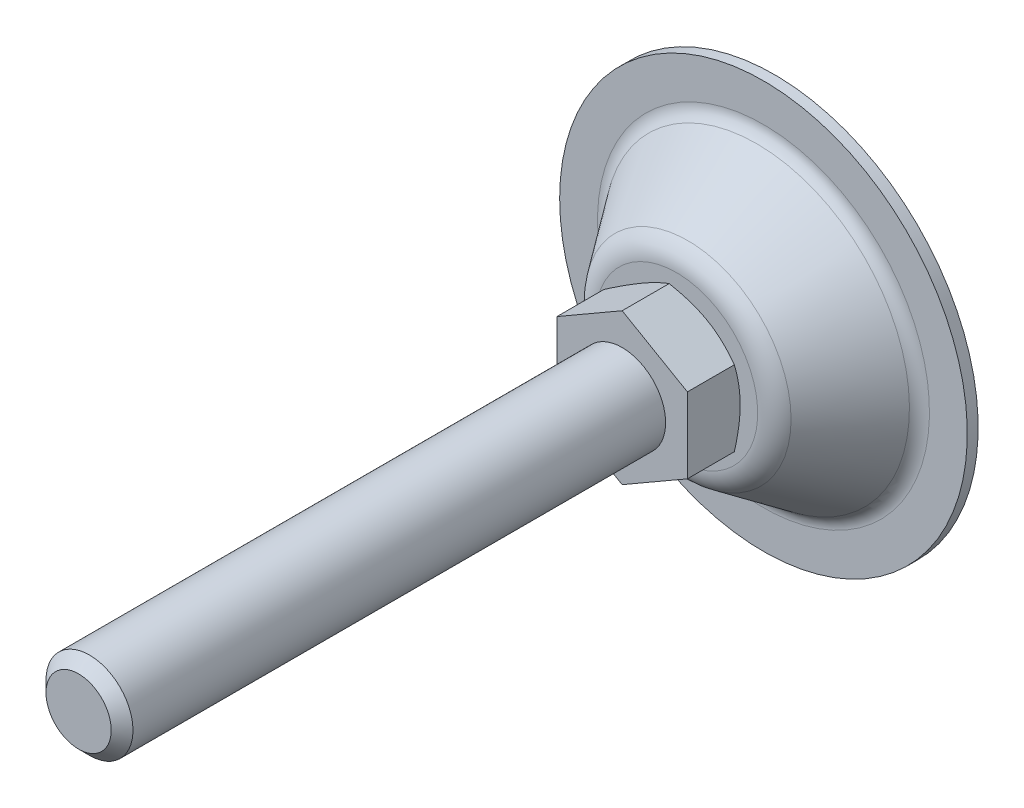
ISO-10303-21;
HEADER;
FILE_DESCRIPTION(('STEP AP214'),'2;1');
FILE_NAME('part.step','',(''),(''),'','','');
FILE_SCHEMA(('AUTOMOTIVE_DESIGN { 1 0 10303 214 1 1 1 1 }'));
ENDSEC;
DATA;
#1=APPLICATION_CONTEXT('core data for automotive mechanical design processes');
#2=APPLICATION_PROTOCOL_DEFINITION('international standard','automotive_design',2000,#1);
#3=PRODUCT_CONTEXT('',#1,'mechanical');
#4=PRODUCT('Part','Part','',(#3));
#5=PRODUCT_RELATED_PRODUCT_CATEGORY('part','',(#4));
#6=PRODUCT_DEFINITION_FORMATION('','',#4);
#7=PRODUCT_DEFINITION_CONTEXT('part definition',#1,'design');
#8=PRODUCT_DEFINITION('design','',#6,#7);
#9=PRODUCT_DEFINITION_SHAPE('','',#8);
#10=(LENGTH_UNIT() NAMED_UNIT(*) SI_UNIT(.MILLI.,.METRE.));
#11=(NAMED_UNIT(*) PLANE_ANGLE_UNIT() SI_UNIT($,.RADIAN.));
#12=(NAMED_UNIT(*) SI_UNIT($,.STERADIAN.) SOLID_ANGLE_UNIT());
#13=UNCERTAINTY_MEASURE_WITH_UNIT(LENGTH_MEASURE(1.E-05),#10,'distance_accuracy_value','');
#14=(GEOMETRIC_REPRESENTATION_CONTEXT(3) GLOBAL_UNCERTAINTY_ASSIGNED_CONTEXT((#13)) GLOBAL_UNIT_ASSIGNED_CONTEXT((#10,
#11,#12)) REPRESENTATION_CONTEXT('',''));
#15=CARTESIAN_POINT('',(0.,0.,0.));
#16=DIRECTION('',(0.,0.,1.));
#17=DIRECTION('',(1.,0.,0.));
#18=AXIS2_PLACEMENT_3D('',#15,#16,#17);
#19=CARTESIAN_POINT('',(0.,0.,28.));
#20=DIRECTION('',(0.,0.,1.));
#21=DIRECTION('',(0.5,-0.866025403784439,0.));
#22=AXIS2_PLACEMENT_3D('',#19,#20,#21);
#23=PLANE('',#22);
#24=DIRECTION('',(0.,1.,0.));
#25=VECTOR('',#24,1.);
#26=CARTESIAN_POINT('',(12.,-6.92820323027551,28.));
#27=LINE('',#26,#25);
#28=CARTESIAN_POINT('',(12.,-6.92820323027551,28.));
#29=VERTEX_POINT('',#28);
#30=CARTESIAN_POINT('',(12.,6.9282032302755,28.));
#31=VERTEX_POINT('',#30);
#32=EDGE_CURVE('E220',#29,#31,#27,.T.);
#33=ORIENTED_EDGE('',*,*,#32,.T.);
#34=DIRECTION('',(-0.866025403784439,0.5,0.));
#35=VECTOR('',#34,1.);
#36=CARTESIAN_POINT('',(12.,6.9282032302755,28.));
#37=LINE('',#36,#35);
#38=CARTESIAN_POINT('',(0.,13.856406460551,28.));
#39=VERTEX_POINT('',#38);
#40=EDGE_CURVE('E361',#31,#39,#37,.T.);
#41=ORIENTED_EDGE('',*,*,#40,.T.);
#42=DIRECTION('',(-0.866025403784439,-0.5,0.));
#43=VECTOR('',#42,1.);
#44=CARTESIAN_POINT('',(0.,13.856406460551,28.));
#45=LINE('',#44,#43);
#46=CARTESIAN_POINT('',(-12.,6.92820323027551,28.));
#47=VERTEX_POINT('',#46);
#48=EDGE_CURVE('E360',#39,#47,#45,.T.);
#49=ORIENTED_EDGE('',*,*,#48,.T.);
#50=DIRECTION('',(0.,-1.,0.));
#51=VECTOR('',#50,1.);
#52=CARTESIAN_POINT('',(-12.,6.92820323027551,28.));
#53=LINE('',#52,#51);
#54=CARTESIAN_POINT('',(-12.,-6.9282032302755,28.));
#55=VERTEX_POINT('',#54);
#56=EDGE_CURVE('E365',#47,#55,#53,.T.);
#57=ORIENTED_EDGE('',*,*,#56,.T.);
#58=DIRECTION('',(0.866025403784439,-0.5,0.));
#59=VECTOR('',#58,1.);
#60=CARTESIAN_POINT('',(-12.,-6.9282032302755,28.));
#61=LINE('',#60,#59);
#62=CARTESIAN_POINT('',(0.,-13.856406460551,28.));
#63=VERTEX_POINT('',#62);
#64=EDGE_CURVE('E367',#55,#63,#61,.T.);
#65=ORIENTED_EDGE('',*,*,#64,.T.);
#66=DIRECTION('',(0.866025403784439,0.5,0.));
#67=VECTOR('',#66,1.);
#68=CARTESIAN_POINT('',(0.,-13.856406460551,28.));
#69=LINE('',#68,#67);
#70=EDGE_CURVE('E37',#63,#29,#69,.T.);
#71=ORIENTED_EDGE('',*,*,#70,.T.);
#72=EDGE_LOOP('',(#33,#41,#49,#57,#65,#71));
#73=FACE_BOUND('',#72,.T.);
#74=CARTESIAN_POINT('',(0.,0.,28.));
#75=DIRECTION('',(0.,0.,1.));
#76=DIRECTION('',(0.5,-0.866025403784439,0.));
#77=AXIS2_PLACEMENT_3D('',#74,#75,#76);
#78=CIRCLE('',#77,8.);
#79=CARTESIAN_POINT('',(4.,-6.92820323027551,28.));
#80=VERTEX_POINT('',#79);
#81=EDGE_CURVE('E224',#80,#80,#78,.T.);
#82=ORIENTED_EDGE('',*,*,#81,.F.);
#83=EDGE_LOOP('',(#82));
#84=FACE_BOUND('',#83,.T.);
#85=ADVANCED_FACE('F14',(#73,#84),#23,.T.);
#86=CARTESIAN_POINT('',(-7.46811554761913,12.9351555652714,18.));
#87=DIRECTION('',(0.,0.,-1.));
#88=DIRECTION('',(-0.5,0.866025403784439,0.));
#89=AXIS2_PLACEMENT_3D('',#86,#87,#88);
#90=PLANE('',#89);
#91=CARTESIAN_POINT('',(-1.37317446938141E-13,2.37840794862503E-13,18.));
#92=DIRECTION('',(0.,0.,1.));
#93=DIRECTION('',(0.5,-0.866025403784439,0.));
#94=AXIS2_PLACEMENT_3D('',#91,#92,#93);
#95=CIRCLE('',#94,14.936231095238);
#96=CARTESIAN_POINT('',(7.46811554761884,-12.9351555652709,18.));
#97=VERTEX_POINT('',#96);
#98=EDGE_CURVE('E111',#97,#97,#95,.T.);
#99=ORIENTED_EDGE('',*,*,#98,.T.);
#100=EDGE_LOOP('',(#99));
#101=FACE_BOUND('',#100,.T.);
#102=CARTESIAN_POINT('',(0.,0.,18.));
#103=DIRECTION('',(0.,0.,-1.));
#104=DIRECTION('',(-0.5,0.866025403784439,0.));
#105=AXIS2_PLACEMENT_3D('',#102,#103,#104);
#106=CIRCLE('',#105,11.5);
#107=CARTESIAN_POINT('',(-5.75,9.95929214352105,18.));
#108=VERTEX_POINT('',#107);
#109=EDGE_CURVE('E84',#108,#108,#106,.T.);
#110=ORIENTED_EDGE('',*,*,#109,.T.);
#111=EDGE_LOOP('',(#110));
#112=FACE_BOUND('',#111,.T.);
#113=ADVANCED_FACE('F195',(#101,#112),#90,.F.);
#114=CARTESIAN_POINT('',(-1.54390389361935E-13,2.67411998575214E-13,4.9999999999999));
#115=DIRECTION('',(0.,0.,1.));
#116=DIRECTION('',(0.5,-0.866025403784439,0.));
#117=AXIS2_PLACEMENT_3D('',#114,#115,#116);
#118=TOROIDAL_SURFACE('',#117,30.5382613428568,3.);
#119=CARTESIAN_POINT('',(-1.55741344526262E-13,2.69751921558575E-13,3.24909185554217));
#120=DIRECTION('',(0.,0.,1.));
#121=DIRECTION('',(0.5,-0.866025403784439,0.));
#122=AXIS2_PLACEMENT_3D('',#119,#120,#121);
#123=CIRCLE('',#122,28.1022152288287);
#124=CARTESIAN_POINT('',(14.0511076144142,-24.3372322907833,3.2490918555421));
#125=VERTEX_POINT('',#124);
#126=EDGE_CURVE('E73',#125,#125,#123,.T.);
#127=ORIENTED_EDGE('',*,*,#126,.F.);
#128=EDGE_LOOP('',(#127));
#129=FACE_BOUND('',#128,.T.);
#130=CARTESIAN_POINT('',(-1.57301461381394E-13,2.72454123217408E-13,1.99999999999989));
#131=DIRECTION('',(0.,0.,1.));
#132=DIRECTION('',(0.5,-0.866025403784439,0.));
#133=AXIS2_PLACEMENT_3D('',#130,#131,#132);
#134=CIRCLE('',#133,30.5382613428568);
#135=CARTESIAN_POINT('',(15.2691306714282,-26.446910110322,1.99999999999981));
#136=VERTEX_POINT('',#135);
#137=EDGE_CURVE('E102',#136,#136,#134,.T.);
#138=ORIENTED_EDGE('',*,*,#137,.T.);
#139=EDGE_LOOP('',(#138));
#140=FACE_BOUND('',#139,.T.);
#141=ADVANCED_FACE('F198',(#129,#140),#118,.F.);
#142=CARTESIAN_POINT('',(-1.55741344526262E-13,2.69751921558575E-13,3.24909185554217));
#143=DIRECTION('',(0.,0.,-1.));
#144=DIRECTION('',(-0.5,0.866025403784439,0.));
#145=AXIS2_PLACEMENT_3D('',#142,#143,#144);
#146=CONICAL_SURFACE('',#145,28.1022152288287,0.623199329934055);
#147=CARTESIAN_POINT('',(-1.39917641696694E-13,2.42344464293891E-13,15.9181802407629));
#148=DIRECTION('',(0.,0.,1.));
#149=DIRECTION('',(0.5,-0.866025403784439,0.));
#150=AXIS2_PLACEMENT_3D('',#147,#148,#149);
#151=CIRCLE('',#150,18.9963079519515);
#152=CARTESIAN_POINT('',(9.49815397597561,-16.4512852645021,15.9181802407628));
#153=VERTEX_POINT('',#152);
#154=EDGE_CURVE('E114',#153,#153,#151,.T.);
#155=ORIENTED_EDGE('',*,*,#154,.F.);
#156=EDGE_LOOP('',(#155));
#157=FACE_BOUND('',#156,.T.);
#158=ORIENTED_EDGE('',*,*,#126,.T.);
#159=EDGE_LOOP('',(#158));
#160=FACE_BOUND('',#159,.T.);
#161=ADVANCED_FACE('F202',(#157,#160),#146,.T.);
#162=CARTESIAN_POINT('',(-1.43982048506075E-13,2.49384223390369E-13,13.));
#163=DIRECTION('',(0.,0.,1.));
#164=DIRECTION('',(0.5,-0.866025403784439,0.));
#165=AXIS2_PLACEMENT_3D('',#162,#163,#164);
#166=TOROIDAL_SURFACE('',#165,14.9362310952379,5.);
#167=ORIENTED_EDGE('',*,*,#98,.F.);
#168=EDGE_LOOP('',(#167));
#169=FACE_BOUND('',#168,.T.);
#170=ORIENTED_EDGE('',*,*,#154,.T.);
#171=EDGE_LOOP('',(#170));
#172=FACE_BOUND('',#171,.T.);
#173=ADVANCED_FACE('F193',(#169,#172),#166,.T.);
#174=CARTESIAN_POINT('',(-18.75,32.4759526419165,0.));
#175=DIRECTION('',(0.,0.,1.));
#176=DIRECTION('',(0.5,-0.866025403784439,0.));
#177=AXIS2_PLACEMENT_3D('',#174,#175,#176);
#178=PLANE('',#177);
#179=CARTESIAN_POINT('',(-1.59799463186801E-13,2.76780789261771E-13,-1.38777878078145E-13));
#180=DIRECTION('',(0.,0.,1.));
#181=DIRECTION('',(0.5,-0.866025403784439,0.));
#182=AXIS2_PLACEMENT_3D('',#179,#180,#181);
#183=CIRCLE('',#182,37.5);
#184=CARTESIAN_POINT('',(18.7499999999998,-32.4759526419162,-2.32452945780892E-13));
#185=VERTEX_POINT('',#184);
#186=EDGE_CURVE('E108',#185,#185,#183,.T.);
#187=ORIENTED_EDGE('',*,*,#186,.F.);
#188=EDGE_LOOP('',(#187));
#189=FACE_BOUND('',#188,.T.);
#190=ADVANCED_FACE('F189',(#189),#178,.F.);
#191=CARTESIAN_POINT('',(0.,0.,129.670029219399));
#192=DIRECTION('',(0.,0.,1.));
#193=DIRECTION('',(0.5,-0.866025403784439,0.));
#194=AXIS2_PLACEMENT_3D('',#191,#192,#193);
#195=CYLINDRICAL_SURFACE('',#194,37.5);
#196=CARTESIAN_POINT('',(-1.57301461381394E-13,2.72454123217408E-13,1.99999999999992));
#197=DIRECTION('',(0.,0.,1.));
#198=DIRECTION('',(0.5,-0.866025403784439,0.));
#199=AXIS2_PLACEMENT_3D('',#196,#197,#198);
#200=CIRCLE('',#199,37.5);
#201=CARTESIAN_POINT('',(18.7499999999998,-32.4759526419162,1.99999999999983));
#202=VERTEX_POINT('',#201);
#203=EDGE_CURVE('E105',#202,#202,#200,.T.);
#204=ORIENTED_EDGE('',*,*,#203,.F.);
#205=EDGE_LOOP('',(#204));
#206=FACE_BOUND('',#205,.T.);
#207=ORIENTED_EDGE('',*,*,#186,.T.);
#208=EDGE_LOOP('',(#207));
#209=FACE_BOUND('',#208,.T.);
#210=ADVANCED_FACE('F185',(#206,#209),#195,.T.);
#211=CARTESIAN_POINT('',(-18.75,32.4759526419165,2.));
#212=DIRECTION('',(0.,0.,-1.));
#213=DIRECTION('',(-0.5,0.866025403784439,0.));
#214=AXIS2_PLACEMENT_3D('',#211,#212,#213);
#215=PLANE('',#214);
#216=ORIENTED_EDGE('',*,*,#137,.F.);
#217=EDGE_LOOP('',(#216));
#218=FACE_BOUND('',#217,.T.);
#219=ORIENTED_EDGE('',*,*,#203,.T.);
#220=EDGE_LOOP('',(#219));
#221=FACE_BOUND('',#220,.T.);
#222=ADVANCED_FACE('F130',(#218,#221),#215,.F.);
#223=CARTESIAN_POINT('',(0.,0.,23.6283876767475));
#224=DIRECTION('',(0.,0.,1.));
#225=DIRECTION('',(0.5,-0.866025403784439,0.));
#226=AXIS2_PLACEMENT_3D('',#223,#224,#225);
#227=CONICAL_SURFACE('',#226,21.2486534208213,1.0471975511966);
#228=ORIENTED_EDGE('',*,*,#109,.F.);
#229=EDGE_LOOP('',(#228));
#230=FACE_BOUND('',#229,.T.);
#231=CARTESIAN_POINT('',(-10.0532557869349,-19.6606563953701,24.1094504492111));
#232=CARTESIAN_POINT('',(-9.82653838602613,-19.5297610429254,23.9825738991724));
#233=CARTESIAN_POINT('',(-9.59955317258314,-19.398711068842,23.856335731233));
#234=CARTESIAN_POINT('',(-9.14499119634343,-19.1362695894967,23.6052809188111));
#235=CARTESIAN_POINT('',(-8.91741442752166,-19.0048780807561,23.4804642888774));
#236=CARTESIAN_POINT('',(-8.23365135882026,-18.6101072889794,23.1083304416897));
#237=CARTESIAN_POINT('',(-7.77650041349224,-18.346171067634,22.8633674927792));
#238=CARTESIAN_POINT('',(-6.85659953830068,-17.8150660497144,22.3798814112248));
#239=CARTESIAN_POINT('',(-6.39383263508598,-17.5478874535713,22.1414012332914));
#240=CARTESIAN_POINT('',(-5.46459534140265,-17.0113920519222,21.6742979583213));
#241=CARTESIAN_POINT('',(-4.9981251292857,-16.7420753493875,21.4456743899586));
#242=CARTESIAN_POINT('',(-4.04609504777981,-16.1924205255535,20.9939474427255));
#243=CARTESIAN_POINT('',(-3.56039382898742,-15.912000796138,20.7712391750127));
#244=CARTESIAN_POINT('',(-2.58328268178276,-15.3478654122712,20.3428555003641));
#245=CARTESIAN_POINT('',(-2.09187211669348,-15.0641493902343,20.137182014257));
#246=CARTESIAN_POINT('',(-1.10351639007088,-14.4935219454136,19.7483225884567));
#247=CARTESIAN_POINT('',(-0.606584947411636,-14.2066184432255,19.565090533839));
#248=CARTESIAN_POINT('',(0.394451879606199,-13.628669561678,19.2270309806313));
#249=CARTESIAN_POINT('',(0.898554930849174,-13.3376255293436,19.072194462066));
#250=CARTESIAN_POINT('',(1.65882416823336,-12.8986838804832,18.8672836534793));
#251=CARTESIAN_POINT('',(1.91226998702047,-12.7523568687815,18.8036673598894));
#252=CARTESIAN_POINT('',(2.42088138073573,-12.4587099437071,18.6863216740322));
#253=CARTESIAN_POINT('',(2.6760469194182,-12.3113900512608,18.6325920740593));
#254=CARTESIAN_POINT('',(3.18791661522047,-12.0158619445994,18.5359727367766));
#255=CARTESIAN_POINT('',(3.44462075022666,-11.8676537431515,18.4930828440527));
#256=CARTESIAN_POINT('',(3.95929088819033,-11.5705088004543,18.4190010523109));
#257=CARTESIAN_POINT('',(4.2172568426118,-11.4215720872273,18.3878087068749));
#258=CARTESIAN_POINT('',(4.73074751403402,-11.1251081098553,18.3381289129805));
#259=CARTESIAN_POINT('',(4.98626060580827,-10.977587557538,18.319482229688));
#260=CARTESIAN_POINT('',(5.49773994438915,-10.6822848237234,18.294677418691));
#261=CARTESIAN_POINT('',(5.75370618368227,-10.534502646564,18.2885190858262));
#262=CARTESIAN_POINT('',(6.26563805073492,-10.2389386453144,18.2888371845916));
#263=CARTESIAN_POINT('',(6.5216036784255,-10.091156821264,18.295313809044));
#264=CARTESIAN_POINT('',(7.03307268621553,-9.79586005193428,18.3207453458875));
#265=CARTESIAN_POINT('',(7.28857604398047,-9.64834511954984,18.3397008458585));
#266=CARTESIAN_POINT('',(7.90442793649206,-9.29278286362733,18.4000305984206));
#267=CARTESIAN_POINT('',(8.26434066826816,-9.08498715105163,18.4474404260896));
#268=CARTESIAN_POINT('',(8.98145632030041,-8.67096023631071,18.5644233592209));
#269=CARTESIAN_POINT('',(9.33865885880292,-8.46472925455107,18.6339995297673));
#270=CARTESIAN_POINT('',(10.0500214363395,-8.0540238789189,18.7928402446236));
#271=CARTESIAN_POINT('',(10.4041788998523,-7.84955097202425,18.8821200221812));
#272=CARTESIAN_POINT('',(11.1089234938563,-7.44266649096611,19.077650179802));
#273=CARTESIAN_POINT('',(11.4595106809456,-7.24025488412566,19.1839002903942));
#274=CARTESIAN_POINT('',(12.1650627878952,-6.83290418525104,19.4133803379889));
#275=CARTESIAN_POINT('',(12.5199465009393,-6.62801197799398,19.5369408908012));
#276=CARTESIAN_POINT('',(13.2262157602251,-6.22024723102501,19.7966751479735));
#277=CARTESIAN_POINT('',(13.5776012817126,-6.01737470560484,19.9328489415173));
#278=CARTESIAN_POINT('',(14.2770536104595,-5.61354571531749,20.2156602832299));
#279=CARTESIAN_POINT('',(14.6251214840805,-5.41258863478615,20.3622943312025));
#280=CARTESIAN_POINT('',(15.318378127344,-5.01233672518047,20.664315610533));
#281=CARTESIAN_POINT('',(15.6635669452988,-4.81304186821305,20.8197026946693));
#282=CARTESIAN_POINT('',(16.5374507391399,-4.30850482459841,21.2238005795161));
#283=CARTESIAN_POINT('',(17.0644049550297,-4.00426766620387,21.477525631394));
#284=CARTESIAN_POINT('',(18.1134107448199,-3.39862389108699,21.9981888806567));
#285=CARTESIAN_POINT('',(18.635461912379,-3.097217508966,22.2651281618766));
#286=CARTESIAN_POINT('',(19.6756923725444,-2.49664017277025,22.8093074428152));
#287=CARTESIAN_POINT('',(20.1938705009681,-2.19746989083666,23.0865504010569));
#288=CARTESIAN_POINT('',(21.226926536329,-1.60103471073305,23.6490491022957));
#289=CARTESIAN_POINT('',(21.7418045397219,-1.30376975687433,23.9343046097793));
#290=CARTESIAN_POINT('',(22.7695382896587,-0.710407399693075,24.5115723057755));
#291=CARTESIAN_POINT('',(23.2823905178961,-0.414312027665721,24.8035928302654));
#292=CARTESIAN_POINT('',(24.3058697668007,0.176593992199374,25.3927886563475));
#293=CARTESIAN_POINT('',(24.8164967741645,0.471404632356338,25.689963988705));
#294=CARTESIAN_POINT('',(25.835813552,1.05990744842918,26.2884658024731));
#295=CARTESIAN_POINT('',(26.3445036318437,1.35359980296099,26.5897915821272));
#296=CARTESIAN_POINT('',(27.3603325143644,1.94008888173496,27.1959115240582));
#297=CARTESIAN_POINT('',(27.8674713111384,2.23288560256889,27.5007056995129));
#298=CARTESIAN_POINT('',(29.2909254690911,3.05471724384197,28.3613531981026));
#299=CARTESIAN_POINT('',(30.2057559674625,3.58289487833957,28.9204806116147));
#300=CARTESIAN_POINT('',(32.0322611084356,4.63742811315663,30.0456673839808));
#301=CARTESIAN_POINT('',(32.9439356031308,5.16378362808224,30.6117270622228));
#302=CARTESIAN_POINT('',(34.7622656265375,6.2135969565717,31.7474746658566));
#303=CARTESIAN_POINT('',(35.6689280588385,6.73705875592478,32.3171478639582));
#304=CARTESIAN_POINT('',(37.0274616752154,7.52140850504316,33.174659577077));
#305=CARTESIAN_POINT('',(37.4800486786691,7.78270973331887,33.4609880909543));
#306=CARTESIAN_POINT('',(38.3847950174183,8.30506527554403,34.0345430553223));
#307=CARTESIAN_POINT('',(38.8369543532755,8.5661195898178,34.3217695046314));
#308=CARTESIAN_POINT('',(39.2889251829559,8.82706506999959,34.6093910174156));
#309=B_SPLINE_CURVE_WITH_KNOTS('',3,(#231,#232,#233,#234,#235,#236,#237,#238,#239,#240,#241,
#242,#243,#244,#245,#246,#247,#248,#249,#250,#251,#252,#253,#254,#255,#256,#257,#258,#259,#260,
#261,#262,#263,#264,#265,#266,#267,#268,#269,#270,#271,#272,#273,#274,#275,#276,#277,#278,#279,
#280,#281,#282,#283,#284,#285,#286,#287,#288,#289,#290,#291,#292,#293,#294,#295,#296,#297,#298,
#299,#300,#301,#302,#303,#304,#305,#306,#307,#308),.UNSPECIFIED.,.F.,.F.,(4,2,2,2,2,2,2,2,2,2,2,
2,2,2,2,2,2,2,2,2,2,2,2,2,2,2,2,2,2,2,2,2,2,2,2,2,2,2,4),(0.,0.872745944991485,1.74550081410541,
3.49127289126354,5.24667070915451,7.00198449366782,8.81209333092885,10.6224059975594,
12.4289339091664,14.2348869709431,15.1332127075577,16.0315195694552,16.929813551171,
17.8280732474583,18.7147052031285,19.6013225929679,20.4879535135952,21.3746261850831,
22.6287917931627,23.88313089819,25.1384431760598,26.3937355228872,27.6775150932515,
28.9613037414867,30.2446648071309,31.5280042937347,33.5055452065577,35.4832485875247,
37.4615242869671,39.439741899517,41.4205425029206,43.4013549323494,45.3818364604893,
47.3623255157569,50.9478944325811,54.5336291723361,58.1092552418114,59.8969559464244,
61.6846542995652),.UNSPECIFIED.);
#310=CARTESIAN_POINT('',(0.,-13.856406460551,19.3604719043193));
#311=VERTEX_POINT('',#310);
#312=CARTESIAN_POINT('',(12.,-6.92820323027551,19.3604719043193));
#313=VERTEX_POINT('',#312);
#314=EDGE_CURVE('E65',#311,#313,#309,.T.);
#315=ORIENTED_EDGE('',*,*,#314,.F.);
#316=CARTESIAN_POINT('',(-12.0002,-6.92808776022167,19.3605385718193));
#317=CARTESIAN_POINT('',(-11.7364142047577,-7.08038456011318,19.2726247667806));
#318=CARTESIAN_POINT('',(-11.4716448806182,-7.2332492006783,19.1887011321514));
#319=CARTESIAN_POINT('',(-10.9399829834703,-7.54020434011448,19.0299413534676));
#320=CARTESIAN_POINT('',(-10.6730897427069,-7.69429522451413,18.9551081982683));
#321=CARTESIAN_POINT('',(-9.86810959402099,-8.15905073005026,18.7456926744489));
#322=CARTESIAN_POINT('',(-9.32684492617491,-8.47155003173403,18.6265783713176));
#323=CARTESIAN_POINT('',(-8.51686717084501,-8.93919090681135,18.4869061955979));
#324=CARTESIAN_POINT('',(-8.25057389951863,-9.09293539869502,18.4471189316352));
#325=CARTESIAN_POINT('',(-7.71675440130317,-9.40113622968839,18.3803985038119));
#326=CARTESIAN_POINT('',(-7.44922815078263,-9.55559258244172,18.3534655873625));
#327=CARTESIAN_POINT('',(-6.91372963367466,-9.86476279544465,18.3131437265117));
#328=CARTESIAN_POINT('',(-6.64575827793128,-10.0194761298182,18.2997386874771));
#329=CARTESIAN_POINT('',(-6.10956726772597,-10.3290461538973,18.2867582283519));
#330=CARTESIAN_POINT('',(-5.84134762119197,-10.4839028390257,18.2871823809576));
#331=CARTESIAN_POINT('',(-5.3399106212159,-10.7734076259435,18.3008951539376));
#332=CARTESIAN_POINT('',(-5.10665750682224,-10.908076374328,18.3125111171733));
#333=CARTESIAN_POINT('',(-4.64068775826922,-11.1771041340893,18.3459831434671));
#334=CARTESIAN_POINT('',(-4.40797116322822,-11.3114631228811,18.367839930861));
#335=CARTESIAN_POINT('',(-3.94320092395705,-11.5797983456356,18.4214125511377));
#336=CARTESIAN_POINT('',(-3.71114798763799,-11.7137741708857,18.4531365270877));
#337=CARTESIAN_POINT('',(-3.24813003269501,-11.9810977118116,18.5258869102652));
#338=CARTESIAN_POINT('',(-3.01716508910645,-12.1144453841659,18.566913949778));
#339=CARTESIAN_POINT('',(-2.31605804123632,-12.5192297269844,18.7049867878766));
#340=CARTESIAN_POINT('',(-1.84794625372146,-12.789494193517,18.8158000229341));
#341=CARTESIAN_POINT('',(-0.918702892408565,-13.3259930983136,19.0673009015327));
#342=CARTESIAN_POINT('',(-0.457559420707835,-13.5922344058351,19.2079294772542));
#343=CARTESIAN_POINT('',(0.000199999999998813,-13.8565219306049,19.3605385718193));
#344=B_SPLINE_CURVE_WITH_KNOTS('',3,(#316,#317,#318,#319,#320,#321,#322,#323,#324,#325,#326,
#327,#328,#329,#330,#331,#332,#333,#334,#335,#336,#337,#338,#339,#340,#341,#342,#343),
.UNSPECIFIED.,.F.,.F.,(4,2,2,2,2,2,2,2,2,2,2,2,2,4),(0.,0.951004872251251,1.90232158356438,
3.80900466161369,4.73894551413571,5.6689042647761,6.59775529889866,7.52657763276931,
8.3351464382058,9.14377244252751,9.95306755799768,10.7624176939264,12.4167102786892,
14.0677556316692),.UNSPECIFIED.);
#345=CARTESIAN_POINT('',(-12.,-6.9282032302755,19.3604719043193));
#346=VERTEX_POINT('',#345);
#347=EDGE_CURVE('E68',#346,#311,#344,.T.);
#348=ORIENTED_EDGE('',*,*,#347,.F.);
#349=CARTESIAN_POINT('',(-12.,6.92843417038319,19.3605385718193));
#350=CARTESIAN_POINT('',(-12.,6.62384057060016,19.2726247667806));
#351=CARTESIAN_POINT('',(-12.,6.31811128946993,19.1887011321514));
#352=CARTESIAN_POINT('',(-12.,5.70420101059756,19.0299413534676));
#353=CARTESIAN_POINT('',(-12.,5.39601924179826,18.9551081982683));
#354=CARTESIAN_POINT('',(-12.,4.466508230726,18.7456926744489));
#355=CARTESIAN_POINT('',(-12.,3.84150962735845,18.6265783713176));
#356=CARTESIAN_POINT('',(-12.,2.9062278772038,18.4869061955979));
#357=CARTESIAN_POINT('',(-12.,2.59873889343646,18.4471189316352));
#358=CARTESIAN_POINT('',(-12.,1.98233723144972,18.3803985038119));
#359=CARTESIAN_POINT('',(-12.,1.67342452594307,18.3534655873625));
#360=CARTESIAN_POINT('',(-12.,1.05508409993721,18.3131437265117));
#361=CARTESIAN_POINT('',(-12.,0.745657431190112,18.2997386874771));
#362=CARTESIAN_POINT('',(-12.,0.126517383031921,18.2867582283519));
#363=CARTESIAN_POINT('',(-12.,-0.183195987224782,18.2871823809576));
#364=CARTESIAN_POINT('',(-12.,-0.762205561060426,18.3008951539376));
#365=CARTESIAN_POINT('',(-12.,-1.03154305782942,18.3125111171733));
#366=CARTESIAN_POINT('',(-12.,-1.56959857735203,18.3459831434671));
#367=CARTESIAN_POINT('',(-12.,-1.83831655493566,18.367839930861));
#368=CARTESIAN_POINT('',(-12.,-2.37498700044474,18.4214125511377));
#369=CARTESIAN_POINT('',(-12.,-2.64293865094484,18.4531365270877));
#370=CARTESIAN_POINT('',(-12.,-3.17758573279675,18.5258869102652));
#371=CARTESIAN_POINT('',(-12.,-3.4442810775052,18.566913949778));
#372=CARTESIAN_POINT('',(-12.,-4.25384976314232,18.7049867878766));
#373=CARTESIAN_POINT('',(-12.,-4.79437869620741,18.8158000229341));
#374=CARTESIAN_POINT('',(-12.,-5.86737650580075,19.0673009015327));
#375=CARTESIAN_POINT('',(-12.,-6.39985912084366,19.2079294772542));
#376=CARTESIAN_POINT('',(-12.,-6.92843417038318,19.3605385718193));
#377=B_SPLINE_CURVE_WITH_KNOTS('',3,(#349,#350,#351,#352,#353,#354,#355,#356,#357,#358,#359,
#360,#361,#362,#363,#364,#365,#366,#367,#368,#369,#370,#371,#372,#373,#374,#375,#376),
.UNSPECIFIED.,.F.,.F.,(4,2,2,2,2,2,2,2,2,2,2,2,2,4),(0.,0.951004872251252,1.90232158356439,
3.80900466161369,4.73894551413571,5.6689042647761,6.59775529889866,7.52657763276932,
8.3351464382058,9.14377244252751,9.95306755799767,10.7624176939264,12.4167102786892,
14.0677556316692),.UNSPECIFIED.);
#378=CARTESIAN_POINT('',(-12.,6.92820323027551,19.3604719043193));
#379=VERTEX_POINT('',#378);
#380=EDGE_CURVE('E83',#379,#346,#377,.T.);
#381=ORIENTED_EDGE('',*,*,#380,.F.);
#382=CARTESIAN_POINT('',(-22.0532557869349,1.12395329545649,24.1094504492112));
#383=CARTESIAN_POINT('',(-21.8265383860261,1.25484864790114,23.9825738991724));
#384=CARTESIAN_POINT('',(-21.5995531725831,1.38589862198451,23.856335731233));
#385=CARTESIAN_POINT('',(-21.1449911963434,1.64834010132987,23.6052809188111));
#386=CARTESIAN_POINT('',(-20.9174144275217,1.77973161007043,23.4804642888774));
#387=CARTESIAN_POINT('',(-20.2336513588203,2.1745024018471,23.1083304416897));
#388=CARTESIAN_POINT('',(-19.7765004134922,2.43843862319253,22.8633674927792));
#389=CARTESIAN_POINT('',(-18.8565995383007,2.96954364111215,22.3798814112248));
#390=CARTESIAN_POINT('',(-18.393832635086,3.23672223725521,22.1414012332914));
#391=CARTESIAN_POINT('',(-17.4645953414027,3.77321763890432,21.6742979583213));
#392=CARTESIAN_POINT('',(-16.9981251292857,4.04253434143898,21.4456743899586));
#393=CARTESIAN_POINT('',(-16.0460950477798,4.59218916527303,20.9939474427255));
#394=CARTESIAN_POINT('',(-15.5603938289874,4.87260889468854,20.7712391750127));
#395=CARTESIAN_POINT('',(-14.5832826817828,5.43674427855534,20.3428555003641));
#396=CARTESIAN_POINT('',(-14.0918721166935,5.72046030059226,20.137182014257));
#397=CARTESIAN_POINT('',(-13.1035163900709,6.29108774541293,19.7483225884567));
#398=CARTESIAN_POINT('',(-12.6065849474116,6.57799124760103,19.565090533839));
#399=CARTESIAN_POINT('',(-11.6055481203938,7.1559401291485,19.2270309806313));
#400=CARTESIAN_POINT('',(-11.1014450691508,7.44698416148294,19.072194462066));
#401=CARTESIAN_POINT('',(-10.3411758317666,7.8859258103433,18.8672836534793));
#402=CARTESIAN_POINT('',(-10.0877300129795,8.03225282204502,18.8036673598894));
#403=CARTESIAN_POINT('',(-9.57911861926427,8.32589974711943,18.6863216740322));
#404=CARTESIAN_POINT('',(-9.3239530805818,8.47321963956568,18.6325920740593));
#405=CARTESIAN_POINT('',(-8.81208338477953,8.76874774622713,18.5359727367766));
#406=CARTESIAN_POINT('',(-8.55537924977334,8.91695594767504,18.4930828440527));
#407=CARTESIAN_POINT('',(-8.04070911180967,9.21410089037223,18.4190010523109));
#408=CARTESIAN_POINT('',(-7.78274315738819,9.36303760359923,18.3878087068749));
#409=CARTESIAN_POINT('',(-7.26925248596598,9.6595015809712,18.3381289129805));
#410=CARTESIAN_POINT('',(-7.01373939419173,9.80702213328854,18.319482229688));
#411=CARTESIAN_POINT('',(-6.50226005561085,10.1023248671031,18.294677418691));
#412=CARTESIAN_POINT('',(-6.24629381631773,10.2501070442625,18.2885190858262));
#413=CARTESIAN_POINT('',(-5.73436194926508,10.5456710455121,18.2888371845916));
#414=CARTESIAN_POINT('',(-5.4783963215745,10.6934528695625,18.295313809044));
#415=CARTESIAN_POINT('',(-4.96692731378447,10.9887496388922,18.3207453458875));
#416=CARTESIAN_POINT('',(-4.71142395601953,11.1362645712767,18.3397008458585));
#417=CARTESIAN_POINT('',(-4.09557206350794,11.4918268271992,18.4000305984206));
#418=CARTESIAN_POINT('',(-3.73565933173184,11.6996225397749,18.4474404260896));
#419=CARTESIAN_POINT('',(-3.01854367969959,12.1136494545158,18.5644233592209));
#420=CARTESIAN_POINT('',(-2.66134114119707,12.3198804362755,18.6339995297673));
#421=CARTESIAN_POINT('',(-1.9499785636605,12.7305858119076,18.7928402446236));
#422=CARTESIAN_POINT('',(-1.59582110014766,12.9350587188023,18.8821200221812));
#423=CARTESIAN_POINT('',(-0.891076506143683,13.3419431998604,19.077650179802));
#424=CARTESIAN_POINT('',(-0.540489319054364,13.5443548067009,19.1839002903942));
#425=CARTESIAN_POINT('',(0.165062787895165,13.9517055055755,19.4133803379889));
#426=CARTESIAN_POINT('',(0.519946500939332,14.1565977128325,19.5369408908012));
#427=CARTESIAN_POINT('',(1.22621576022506,14.5643624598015,19.7966751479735));
#428=CARTESIAN_POINT('',(1.57760128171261,14.7672349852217,19.9328489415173));
#429=CARTESIAN_POINT('',(2.27705361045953,15.171063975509,20.2156602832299));
#430=CARTESIAN_POINT('',(2.62512148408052,15.3720210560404,20.3622943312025));
#431=CARTESIAN_POINT('',(3.31837812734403,15.7722729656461,20.664315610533));
#432=CARTESIAN_POINT('',(3.66356694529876,15.9715678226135,20.8197026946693));
#433=CARTESIAN_POINT('',(4.53745073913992,16.4761048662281,21.2238005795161));
#434=CARTESIAN_POINT('',(5.06440495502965,16.7803420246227,21.477525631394));
#435=CARTESIAN_POINT('',(6.1134107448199,17.3859857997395,21.9981888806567));
#436=CARTESIAN_POINT('',(6.63546191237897,17.6873921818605,22.2651281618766));
#437=CARTESIAN_POINT('',(7.67569237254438,18.2879695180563,22.8093074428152));
#438=CARTESIAN_POINT('',(8.19387050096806,18.5871397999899,23.0865504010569));
#439=CARTESIAN_POINT('',(9.22692653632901,19.1835749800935,23.6490491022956));
#440=CARTESIAN_POINT('',(9.74180453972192,19.4808399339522,23.9343046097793));
#441=CARTESIAN_POINT('',(10.7695382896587,20.0742022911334,24.5115723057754));
#442=CARTESIAN_POINT('',(11.2823905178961,20.3702976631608,24.8035928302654));
#443=CARTESIAN_POINT('',(12.3058697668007,20.9612036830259,25.3927886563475));
#444=CARTESIAN_POINT('',(12.8164967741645,21.2560143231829,25.689963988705));
#445=CARTESIAN_POINT('',(13.835813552,21.8445171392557,26.2884658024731));
#446=CARTESIAN_POINT('',(14.3445036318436,22.1382094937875,26.5897915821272));
#447=CARTESIAN_POINT('',(15.3603325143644,22.7246985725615,27.1959115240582));
#448=CARTESIAN_POINT('',(15.8674713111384,23.0174952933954,27.5007056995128));
#449=CARTESIAN_POINT('',(17.2909254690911,23.8393269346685,28.3613531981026));
#450=CARTESIAN_POINT('',(18.2057559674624,24.3675045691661,28.9204806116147));
#451=CARTESIAN_POINT('',(20.0322611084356,25.4220378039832,30.0456673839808));
#452=CARTESIAN_POINT('',(20.9439356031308,25.9483933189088,30.6117270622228));
#453=CARTESIAN_POINT('',(22.7622656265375,26.9982066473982,31.7474746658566));
#454=CARTESIAN_POINT('',(23.6689280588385,27.5216684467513,32.3171478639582));
#455=CARTESIAN_POINT('',(25.0274616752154,28.3060181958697,33.1746595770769));
#456=CARTESIAN_POINT('',(25.4800486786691,28.5673194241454,33.4609880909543));
#457=CARTESIAN_POINT('',(26.3847950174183,29.0896749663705,34.0345430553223));
#458=CARTESIAN_POINT('',(26.8369543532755,29.3507292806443,34.3217695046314));
#459=CARTESIAN_POINT('',(27.2889251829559,29.6116747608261,34.6093910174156));
#460=B_SPLINE_CURVE_WITH_KNOTS('',3,(#382,#383,#384,#385,#386,#387,#388,#389,#390,#391,#392,
#393,#394,#395,#396,#397,#398,#399,#400,#401,#402,#403,#404,#405,#406,#407,#408,#409,#410,#411,
#412,#413,#414,#415,#416,#417,#418,#419,#420,#421,#422,#423,#424,#425,#426,#427,#428,#429,#430,
#431,#432,#433,#434,#435,#436,#437,#438,#439,#440,#441,#442,#443,#444,#445,#446,#447,#448,#449,
#450,#451,#452,#453,#454,#455,#456,#457,#458,#459),.UNSPECIFIED.,.F.,.F.,(4,2,2,2,2,2,2,2,2,2,2,
2,2,2,2,2,2,2,2,2,2,2,2,2,2,2,2,2,2,2,2,2,2,2,2,2,2,2,4),(0.,0.872745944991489,1.74550081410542,
3.49127289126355,5.24667070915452,7.00198449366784,8.81209333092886,10.6224059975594,
12.4289339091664,14.2348869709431,15.1332127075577,16.0315195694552,16.9298135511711,
17.8280732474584,18.7147052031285,19.6013225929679,20.4879535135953,21.3746261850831,
22.6287917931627,23.88313089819,25.1384431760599,26.3937355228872,27.6775150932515,
28.9613037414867,30.244664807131,31.5280042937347,33.5055452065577,35.4832485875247,
37.4615242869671,39.439741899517,41.4205425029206,43.4013549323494,45.3818364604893,
47.3623255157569,50.9478944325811,54.5336291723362,58.1092552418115,59.8969559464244,
61.6846542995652),.UNSPECIFIED.);
#461=CARTESIAN_POINT('',(0.,13.856406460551,19.3604719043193));
#462=VERTEX_POINT('',#461);
#463=EDGE_CURVE('E152',#462,#379,#460,.F.);
#464=ORIENTED_EDGE('',*,*,#463,.F.);
#465=CARTESIAN_POINT('',(12.0002,6.92808776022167,19.3605385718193));
#466=CARTESIAN_POINT('',(11.7364142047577,7.08038456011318,19.2726247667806));
#467=CARTESIAN_POINT('',(11.4716448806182,7.2332492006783,19.1887011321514));
#468=CARTESIAN_POINT('',(10.9399829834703,7.54020434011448,19.0299413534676));
#469=CARTESIAN_POINT('',(10.6730897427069,7.69429522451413,18.9551081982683));
#470=CARTESIAN_POINT('',(9.86810959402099,8.15905073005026,18.7456926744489));
#471=CARTESIAN_POINT('',(9.32684492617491,8.47155003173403,18.6265783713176));
#472=CARTESIAN_POINT('',(8.51686717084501,8.93919090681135,18.4869061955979));
#473=CARTESIAN_POINT('',(8.25057389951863,9.09293539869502,18.4471189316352));
#474=CARTESIAN_POINT('',(7.71675440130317,9.40113622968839,18.3803985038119));
#475=CARTESIAN_POINT('',(7.44922815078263,9.55559258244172,18.3534655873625));
#476=CARTESIAN_POINT('',(6.91372963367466,9.86476279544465,18.3131437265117));
#477=CARTESIAN_POINT('',(6.64575827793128,10.0194761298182,18.2997386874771));
#478=CARTESIAN_POINT('',(6.10956726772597,10.3290461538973,18.2867582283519));
#479=CARTESIAN_POINT('',(5.84134762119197,10.4839028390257,18.2871823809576));
#480=CARTESIAN_POINT('',(5.3399106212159,10.7734076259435,18.3008951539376));
#481=CARTESIAN_POINT('',(5.10665750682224,10.908076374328,18.3125111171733));
#482=CARTESIAN_POINT('',(4.64068775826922,11.1771041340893,18.3459831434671));
#483=CARTESIAN_POINT('',(4.40797116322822,11.3114631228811,18.367839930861));
#484=CARTESIAN_POINT('',(3.94320092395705,11.5797983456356,18.4214125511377));
#485=CARTESIAN_POINT('',(3.71114798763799,11.7137741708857,18.4531365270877));
#486=CARTESIAN_POINT('',(3.24813003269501,11.9810977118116,18.5258869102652));
#487=CARTESIAN_POINT('',(3.01716508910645,12.1144453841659,18.566913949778));
#488=CARTESIAN_POINT('',(2.31605804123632,12.5192297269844,18.7049867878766));
#489=CARTESIAN_POINT('',(1.84794625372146,12.789494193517,18.8158000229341));
#490=CARTESIAN_POINT('',(0.918702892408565,13.3259930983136,19.0673009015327));
#491=CARTESIAN_POINT('',(0.457559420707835,13.5922344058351,19.2079294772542));
#492=CARTESIAN_POINT('',(-0.000199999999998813,13.8565219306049,19.3605385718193));
#493=B_SPLINE_CURVE_WITH_KNOTS('',3,(#465,#466,#467,#468,#469,#470,#471,#472,#473,#474,#475,
#476,#477,#478,#479,#480,#481,#482,#483,#484,#485,#486,#487,#488,#489,#490,#491,#492),
.UNSPECIFIED.,.F.,.F.,(4,2,2,2,2,2,2,2,2,2,2,2,2,4),(0.,0.951004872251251,1.90232158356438,
3.80900466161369,4.73894551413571,5.6689042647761,6.59775529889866,7.52657763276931,
8.3351464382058,9.14377244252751,9.95306755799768,10.7624176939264,12.4167102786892,
14.0677556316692),.UNSPECIFIED.);
#494=CARTESIAN_POINT('',(12.,6.9282032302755,19.3604719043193));
#495=VERTEX_POINT('',#494);
#496=EDGE_CURVE('E159',#495,#462,#493,.T.);
#497=ORIENTED_EDGE('',*,*,#496,.F.);
#498=CARTESIAN_POINT('',(12.,-6.92843417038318,19.3605385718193));
#499=CARTESIAN_POINT('',(12.,-6.62384057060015,19.2726247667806));
#500=CARTESIAN_POINT('',(12.,-6.31811128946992,19.1887011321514));
#501=CARTESIAN_POINT('',(12.,-5.70420101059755,19.0299413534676));
#502=CARTESIAN_POINT('',(12.,-5.39601924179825,18.9551081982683));
#503=CARTESIAN_POINT('',(12.,-4.46650823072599,18.7456926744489));
#504=CARTESIAN_POINT('',(12.,-3.84150962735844,18.6265783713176));
#505=CARTESIAN_POINT('',(12.,-2.9062278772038,18.4869061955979));
#506=CARTESIAN_POINT('',(12.,-2.59873889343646,18.4471189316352));
#507=CARTESIAN_POINT('',(12.,-1.98233723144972,18.3803985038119));
#508=CARTESIAN_POINT('',(12.,-1.67342452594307,18.3534655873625));
#509=CARTESIAN_POINT('',(12.,-1.05508409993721,18.3131437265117));
#510=CARTESIAN_POINT('',(12.,-0.745657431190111,18.2997386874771));
#511=CARTESIAN_POINT('',(12.,-0.12651738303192,18.2867582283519));
#512=CARTESIAN_POINT('',(12.,0.183195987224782,18.2871823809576));
#513=CARTESIAN_POINT('',(12.,0.762205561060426,18.3008951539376));
#514=CARTESIAN_POINT('',(12.,1.03154305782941,18.3125111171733));
#515=CARTESIAN_POINT('',(12.,1.56959857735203,18.3459831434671));
#516=CARTESIAN_POINT('',(12.,1.83831655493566,18.367839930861));
#517=CARTESIAN_POINT('',(12.,2.37498700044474,18.4214125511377));
#518=CARTESIAN_POINT('',(12.,2.64293865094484,18.4531365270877));
#519=CARTESIAN_POINT('',(12.,3.17758573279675,18.5258869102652));
#520=CARTESIAN_POINT('',(12.,3.4442810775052,18.566913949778));
#521=CARTESIAN_POINT('',(12.,4.25384976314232,18.7049867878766));
#522=CARTESIAN_POINT('',(12.,4.79437869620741,18.8158000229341));
#523=CARTESIAN_POINT('',(12.,5.86737650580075,19.0673009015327));
#524=CARTESIAN_POINT('',(12.,6.39985912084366,19.2079294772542));
#525=CARTESIAN_POINT('',(12.,6.92843417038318,19.3605385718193));
#526=B_SPLINE_CURVE_WITH_KNOTS('',3,(#498,#499,#500,#501,#502,#503,#504,#505,#506,#507,#508,
#509,#510,#511,#512,#513,#514,#515,#516,#517,#518,#519,#520,#521,#522,#523,#524,#525),
.UNSPECIFIED.,.F.,.F.,(4,2,2,2,2,2,2,2,2,2,2,2,2,4),(0.,0.951004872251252,1.90232158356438,
3.80900466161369,4.7389455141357,5.66890426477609,6.59775529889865,7.52657763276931,
8.33514643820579,9.1437724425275,9.95306755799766,10.7624176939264,12.4167102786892,
14.0677556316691),.UNSPECIFIED.);
#527=EDGE_CURVE('E29',#313,#495,#526,.T.);
#528=ORIENTED_EDGE('',*,*,#527,.F.);
#529=EDGE_LOOP('',(#315,#348,#381,#464,#497,#528));
#530=FACE_BOUND('',#529,.T.);
#531=ADVANCED_FACE('F67',(#230,#530),#227,.T.);
#532=CARTESIAN_POINT('',(0.,-13.856406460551,28.));
#533=DIRECTION('',(-0.5,0.866025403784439,0.));
#534=DIRECTION('',(0.,0.,1.));
#535=AXIS2_PLACEMENT_3D('',#532,#533,#534);
#536=PLANE('',#535);
#537=DIRECTION('',(0.,0.,-1.));
#538=VECTOR('',#537,1.);
#539=CARTESIAN_POINT('',(0.,-13.856406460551,28.));
#540=LINE('',#539,#538);
#541=EDGE_CURVE('E80',#63,#311,#540,.T.);
#542=ORIENTED_EDGE('',*,*,#541,.T.);
#543=ORIENTED_EDGE('',*,*,#314,.T.);
#544=DIRECTION('',(0.,0.,-1.));
#545=VECTOR('',#544,1.);
#546=CARTESIAN_POINT('',(12.,-6.92820323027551,28.));
#547=LINE('',#546,#545);
#548=EDGE_CURVE('E87',#29,#313,#547,.T.);
#549=ORIENTED_EDGE('',*,*,#548,.F.);
#550=ORIENTED_EDGE('',*,*,#70,.F.);
#551=EDGE_LOOP('',(#542,#543,#549,#550));
#552=FACE_BOUND('',#551,.T.);
#553=ADVANCED_FACE('F86',(#552),#536,.F.);
#554=CARTESIAN_POINT('',(-12.,-6.9282032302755,28.));
#555=DIRECTION('',(0.5,0.866025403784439,0.));
#556=DIRECTION('',(-0.866025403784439,0.5,0.));
#557=AXIS2_PLACEMENT_3D('',#554,#555,#556);
#558=PLANE('',#557);
#559=DIRECTION('',(0.,0.,-1.));
#560=VECTOR('',#559,1.);
#561=CARTESIAN_POINT('',(-12.,-6.9282032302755,28.));
#562=LINE('',#561,#560);
#563=EDGE_CURVE('E82',#55,#346,#562,.T.);
#564=ORIENTED_EDGE('',*,*,#563,.T.);
#565=ORIENTED_EDGE('',*,*,#347,.T.);
#566=ORIENTED_EDGE('',*,*,#541,.F.);
#567=ORIENTED_EDGE('',*,*,#64,.F.);
#568=EDGE_LOOP('',(#564,#565,#566,#567));
#569=FACE_BOUND('',#568,.T.);
#570=ADVANCED_FACE('F78',(#569),#558,.F.);
#571=CARTESIAN_POINT('',(-12.,6.92820323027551,28.));
#572=DIRECTION('',(1.,0.,0.));
#573=DIRECTION('',(0.,1.,0.));
#574=AXIS2_PLACEMENT_3D('',#571,#572,#573);
#575=PLANE('',#574);
#576=DIRECTION('',(0.,0.,-1.));
#577=VECTOR('',#576,1.);
#578=CARTESIAN_POINT('',(-12.,6.92820323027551,28.));
#579=LINE('',#578,#577);
#580=EDGE_CURVE('E89',#47,#379,#579,.T.);
#581=ORIENTED_EDGE('',*,*,#580,.T.);
#582=ORIENTED_EDGE('',*,*,#380,.T.);
#583=ORIENTED_EDGE('',*,*,#563,.F.);
#584=ORIENTED_EDGE('',*,*,#56,.F.);
#585=EDGE_LOOP('',(#581,#582,#583,#584));
#586=FACE_BOUND('',#585,.T.);
#587=ADVANCED_FACE('F338',(#586),#575,.F.);
#588=CARTESIAN_POINT('',(0.,13.856406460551,28.));
#589=DIRECTION('',(0.5,-0.866025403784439,0.));
#590=DIRECTION('',(0.,0.,-1.));
#591=AXIS2_PLACEMENT_3D('',#588,#589,#590);
#592=PLANE('',#591);
#593=DIRECTION('',(0.,0.,-1.));
#594=VECTOR('',#593,1.);
#595=CARTESIAN_POINT('',(0.,13.856406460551,28.));
#596=LINE('',#595,#594);
#597=EDGE_CURVE('E96',#39,#462,#596,.T.);
#598=ORIENTED_EDGE('',*,*,#597,.T.);
#599=ORIENTED_EDGE('',*,*,#463,.T.);
#600=ORIENTED_EDGE('',*,*,#580,.F.);
#601=ORIENTED_EDGE('',*,*,#48,.F.);
#602=EDGE_LOOP('',(#598,#599,#600,#601));
#603=FACE_BOUND('',#602,.T.);
#604=ADVANCED_FACE('F176',(#603),#592,.F.);
#605=CARTESIAN_POINT('',(12.,6.9282032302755,28.));
#606=DIRECTION('',(-0.5,-0.866025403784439,0.));
#607=DIRECTION('',(0.866025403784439,-0.5,0.));
#608=AXIS2_PLACEMENT_3D('',#605,#606,#607);
#609=PLANE('',#608);
#610=DIRECTION('',(0.,0.,-1.));
#611=VECTOR('',#610,1.);
#612=CARTESIAN_POINT('',(12.,6.9282032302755,28.));
#613=LINE('',#612,#611);
#614=EDGE_CURVE('E99',#31,#495,#613,.T.);
#615=ORIENTED_EDGE('',*,*,#614,.T.);
#616=ORIENTED_EDGE('',*,*,#496,.T.);
#617=ORIENTED_EDGE('',*,*,#597,.F.);
#618=ORIENTED_EDGE('',*,*,#40,.F.);
#619=EDGE_LOOP('',(#615,#616,#617,#618));
#620=FACE_BOUND('',#619,.T.);
#621=ADVANCED_FACE('F172',(#620),#609,.F.);
#622=CARTESIAN_POINT('',(12.,-6.92820323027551,28.));
#623=DIRECTION('',(-1.,0.,0.));
#624=DIRECTION('',(0.,-1.,0.));
#625=AXIS2_PLACEMENT_3D('',#622,#623,#624);
#626=PLANE('',#625);
#627=ORIENTED_EDGE('',*,*,#548,.T.);
#628=ORIENTED_EDGE('',*,*,#527,.T.);
#629=ORIENTED_EDGE('',*,*,#614,.F.);
#630=ORIENTED_EDGE('',*,*,#32,.F.);
#631=EDGE_LOOP('',(#627,#628,#629,#630));
#632=FACE_BOUND('',#631,.T.);
#633=ADVANCED_FACE('F175',(#632),#626,.F.);
#634=CARTESIAN_POINT('',(0.,0.,128.));
#635=DIRECTION('',(0.,0.,-1.));
#636=DIRECTION('',(-0.5,0.866025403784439,0.));
#637=AXIS2_PLACEMENT_3D('',#634,#635,#636);
#638=CYLINDRICAL_SURFACE('',#637,8.);
#639=CARTESIAN_POINT('',(0.,0.,126.));
#640=DIRECTION('',(0.,0.,1.));
#641=DIRECTION('',(0.5,-0.866025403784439,0.));
#642=AXIS2_PLACEMENT_3D('',#639,#640,#641);
#643=CIRCLE('',#642,8.);
#644=CARTESIAN_POINT('',(4.,-6.92820323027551,126.));
#645=VERTEX_POINT('',#644);
#646=EDGE_CURVE('E9',#645,#645,#643,.F.);
#647=ORIENTED_EDGE('',*,*,#646,.T.);
#648=EDGE_LOOP('',(#647));
#649=FACE_BOUND('',#648,.T.);
#650=ORIENTED_EDGE('',*,*,#81,.T.);
#651=EDGE_LOOP('',(#650));
#652=FACE_BOUND('',#651,.T.);
#653=ADVANCED_FACE('F132',(#649,#652),#638,.T.);
#654=CARTESIAN_POINT('',(0.,0.,128.));
#655=DIRECTION('',(0.,0.,1.));
#656=DIRECTION('',(0.5,-0.866025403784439,0.));
#657=AXIS2_PLACEMENT_3D('',#654,#655,#656);
#658=PLANE('',#657);
#659=CARTESIAN_POINT('',(0.,0.,128.));
#660=DIRECTION('',(0.,0.,1.));
#661=DIRECTION('',(0.5,-0.866025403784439,0.));
#662=AXIS2_PLACEMENT_3D('',#659,#660,#661);
#663=CIRCLE('',#662,6.);
#664=CARTESIAN_POINT('',(3.,-5.19615242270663,128.));
#665=VERTEX_POINT('',#664);
#666=EDGE_CURVE('E22',#665,#665,#663,.T.);
#667=ORIENTED_EDGE('',*,*,#666,.T.);
#668=EDGE_LOOP('',(#667));
#669=FACE_BOUND('',#668,.T.);
#670=ADVANCED_FACE('F231',(#669),#658,.T.);
#671=CARTESIAN_POINT('',(0.,0.,128.));
#672=DIRECTION('',(0.,0.,-1.));
#673=DIRECTION('',(-0.5,0.866025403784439,0.));
#674=AXIS2_PLACEMENT_3D('',#671,#672,#673);
#675=CONICAL_SURFACE('',#674,6.,0.785398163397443);
#676=ORIENTED_EDGE('',*,*,#646,.F.);
#677=EDGE_LOOP('',(#676));
#678=FACE_BOUND('',#677,.T.);
#679=ORIENTED_EDGE('',*,*,#666,.F.);
#680=EDGE_LOOP('',(#679));
#681=FACE_BOUND('',#680,.T.);
#682=ADVANCED_FACE('F16',(#678,#681),#675,.T.);
#683=CLOSED_SHELL('',(#85,#113,#141,#161,#173,#190,#210,#222,#531,#553,#570,#587,#604,#621,#633,
#653,#670,#682));
#684=MANIFOLD_SOLID_BREP('B1',#683);
#685=ADVANCED_BREP_SHAPE_REPRESENTATION('',(#18,#684),#14);
#686=SHAPE_DEFINITION_REPRESENTATION(#9,#685);
ENDSEC;
END-ISO-10303-21;
